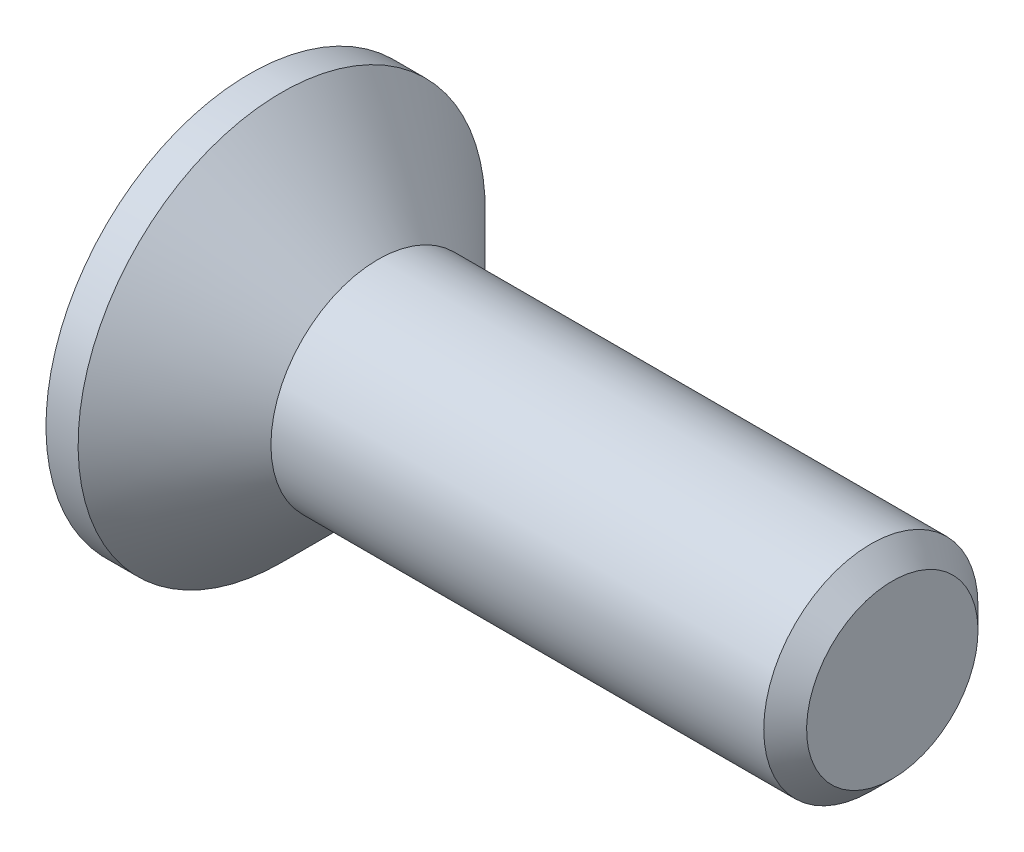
ISO-10303-21;
HEADER;
FILE_DESCRIPTION(('STEP AP214'),'2;1');
FILE_NAME('part.step','',(''),(''),'','','');
FILE_SCHEMA(('AUTOMOTIVE_DESIGN { 1 0 10303 214 1 1 1 1 }'));
ENDSEC;
DATA;
#1=APPLICATION_CONTEXT('core data for automotive mechanical design processes');
#2=APPLICATION_PROTOCOL_DEFINITION('international standard','automotive_design',2000,#1);
#3=PRODUCT_CONTEXT('',#1,'mechanical');
#4=PRODUCT('Part','Part','',(#3));
#5=PRODUCT_RELATED_PRODUCT_CATEGORY('part','',(#4));
#6=PRODUCT_DEFINITION_FORMATION('','',#4);
#7=PRODUCT_DEFINITION_CONTEXT('part definition',#1,'design');
#8=PRODUCT_DEFINITION('design','',#6,#7);
#9=PRODUCT_DEFINITION_SHAPE('','',#8);
#10=(LENGTH_UNIT() NAMED_UNIT(*) SI_UNIT(.MILLI.,.METRE.));
#11=(NAMED_UNIT(*) PLANE_ANGLE_UNIT() SI_UNIT($,.RADIAN.));
#12=(NAMED_UNIT(*) SI_UNIT($,.STERADIAN.) SOLID_ANGLE_UNIT());
#13=UNCERTAINTY_MEASURE_WITH_UNIT(LENGTH_MEASURE(1.E-05),#10,'distance_accuracy_value','');
#14=(GEOMETRIC_REPRESENTATION_CONTEXT(3) GLOBAL_UNCERTAINTY_ASSIGNED_CONTEXT((#13)) GLOBAL_UNIT_ASSIGNED_CONTEXT((#10,
#11,#12)) REPRESENTATION_CONTEXT('',''));
#15=CARTESIAN_POINT('',(0.,0.,0.));
#16=DIRECTION('',(0.,0.,1.));
#17=DIRECTION('',(1.,0.,0.));
#18=AXIS2_PLACEMENT_3D('',#15,#16,#17);
#19=CARTESIAN_POINT('',(0.,0.,0.));
#20=DIRECTION('',(-1.,0.,0.));
#21=DIRECTION('',(0.,-1.,0.));
#22=AXIS2_PLACEMENT_3D('',#19,#20,#21);
#23=CONICAL_SURFACE('',#22,1.,0.78539816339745);
#24=CARTESIAN_POINT('',(-0.899999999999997,0.,0.));
#25=DIRECTION('',(-1.,0.,0.));
#26=DIRECTION('',(0.,-1.,0.));
#27=AXIS2_PLACEMENT_3D('',#24,#25,#26);
#28=CIRCLE('',#27,1.9);
#29=CARTESIAN_POINT('',(-0.899999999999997,-1.9,0.));
#30=VERTEX_POINT('',#29);
#31=EDGE_CURVE('E189',#30,#30,#28,.T.);
#32=ORIENTED_EDGE('',*,*,#31,.F.);
#33=EDGE_LOOP('',(#32));
#34=FACE_BOUND('',#33,.T.);
#35=CARTESIAN_POINT('',(0.,0.,0.));
#36=DIRECTION('',(-1.,0.,0.));
#37=DIRECTION('',(0.,-1.,0.));
#38=AXIS2_PLACEMENT_3D('',#35,#36,#37);
#39=CIRCLE('',#38,1.);
#40=CARTESIAN_POINT('',(0.,-1.,0.));
#41=VERTEX_POINT('',#40);
#42=EDGE_CURVE('E212',#41,#41,#39,.T.);
#43=ORIENTED_EDGE('',*,*,#42,.T.);
#44=EDGE_LOOP('',(#43));
#45=FACE_BOUND('',#44,.T.);
#46=ADVANCED_FACE('F33',(#34,#45),#23,.T.);
#47=CARTESIAN_POINT('',(-1.2,0.,0.));
#48=DIRECTION('',(-1.,0.,0.));
#49=DIRECTION('',(0.,-1.,0.));
#50=AXIS2_PLACEMENT_3D('',#47,#48,#49);
#51=CYLINDRICAL_SURFACE('',#50,1.);
#52=CARTESIAN_POINT('',(4.6,0.,0.));
#53=DIRECTION('',(-1.,0.,0.));
#54=DIRECTION('',(0.,-1.,0.));
#55=AXIS2_PLACEMENT_3D('',#52,#53,#54);
#56=CIRCLE('',#55,1.);
#57=CARTESIAN_POINT('',(4.6,-1.,0.));
#58=VERTEX_POINT('',#57);
#59=EDGE_CURVE('E41',#58,#58,#56,.T.);
#60=ORIENTED_EDGE('',*,*,#59,.T.);
#61=EDGE_LOOP('',(#60));
#62=FACE_BOUND('',#61,.T.);
#63=ORIENTED_EDGE('',*,*,#42,.F.);
#64=EDGE_LOOP('',(#63));
#65=FACE_BOUND('',#64,.T.);
#66=ADVANCED_FACE('F217',(#62,#65),#51,.T.);
#67=CARTESIAN_POINT('',(4.8,0.,0.));
#68=DIRECTION('',(-1.,0.,0.));
#69=DIRECTION('',(0.,-1.,0.));
#70=AXIS2_PLACEMENT_3D('',#67,#68,#69);
#71=PLANE('',#70);
#72=CARTESIAN_POINT('',(4.8,0.,0.));
#73=DIRECTION('',(-1.,0.,0.));
#74=DIRECTION('',(0.,-1.,0.));
#75=AXIS2_PLACEMENT_3D('',#72,#73,#74);
#76=CIRCLE('',#75,0.799999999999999);
#77=CARTESIAN_POINT('',(4.8,-0.799999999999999,0.));
#78=VERTEX_POINT('',#77);
#79=EDGE_CURVE('E11',#78,#78,#76,.F.);
#80=ORIENTED_EDGE('',*,*,#79,.T.);
#81=EDGE_LOOP('',(#80));
#82=FACE_BOUND('',#81,.T.);
#83=ADVANCED_FACE('F239',(#82),#71,.F.);
#84=CARTESIAN_POINT('',(-1.2,1.9,0.));
#85=DIRECTION('',(1.,0.,0.));
#86=DIRECTION('',(0.,1.,0.));
#87=AXIS2_PLACEMENT_3D('',#84,#85,#86);
#88=PLANE('',#87);
#89=DIRECTION('',(0.,0.,-1.));
#90=VECTOR('',#89,1.);
#91=CARTESIAN_POINT('',(-1.2,0.3,-1.175));
#92=LINE('',#91,#90);
#93=CARTESIAN_POINT('',(-1.2,0.3,-0.3));
#94=VERTEX_POINT('',#93);
#95=CARTESIAN_POINT('',(-1.2,0.3,-1.175));
#96=VERTEX_POINT('',#95);
#97=EDGE_CURVE('E158',#94,#96,#92,.T.);
#98=ORIENTED_EDGE('',*,*,#97,.F.);
#99=DIRECTION('',(0.,-1.,0.));
#100=VECTOR('',#99,1.);
#101=CARTESIAN_POINT('',(-1.2,0.3,-0.3));
#102=LINE('',#101,#100);
#103=CARTESIAN_POINT('',(-1.2,1.175,-0.3));
#104=VERTEX_POINT('',#103);
#105=EDGE_CURVE('E48',#104,#94,#102,.T.);
#106=ORIENTED_EDGE('',*,*,#105,.F.);
#107=DIRECTION('',(0.,0.,-1.));
#108=VECTOR('',#107,1.);
#109=CARTESIAN_POINT('',(-1.2,1.175,-0.3));
#110=LINE('',#109,#108);
#111=CARTESIAN_POINT('',(-1.2,1.175,0.3));
#112=VERTEX_POINT('',#111);
#113=EDGE_CURVE('E185',#112,#104,#110,.T.);
#114=ORIENTED_EDGE('',*,*,#113,.F.);
#115=DIRECTION('',(0.,1.,0.));
#116=VECTOR('',#115,1.);
#117=CARTESIAN_POINT('',(-1.2,1.175,0.3));
#118=LINE('',#117,#116);
#119=CARTESIAN_POINT('',(-1.2,0.3,0.3));
#120=VERTEX_POINT('',#119);
#121=EDGE_CURVE('E183',#120,#112,#118,.T.);
#122=ORIENTED_EDGE('',*,*,#121,.F.);
#123=DIRECTION('',(0.,0.,-1.));
#124=VECTOR('',#123,1.);
#125=CARTESIAN_POINT('',(-1.2,0.3,0.3));
#126=LINE('',#125,#124);
#127=CARTESIAN_POINT('',(-1.2,0.3,1.175));
#128=VERTEX_POINT('',#127);
#129=EDGE_CURVE('E132',#128,#120,#126,.T.);
#130=ORIENTED_EDGE('',*,*,#129,.F.);
#131=DIRECTION('',(0.,1.,0.));
#132=VECTOR('',#131,1.);
#133=CARTESIAN_POINT('',(-1.2,0.3,1.175));
#134=LINE('',#133,#132);
#135=CARTESIAN_POINT('',(-1.2,-0.3,1.175));
#136=VERTEX_POINT('',#135);
#137=EDGE_CURVE('E179',#136,#128,#134,.T.);
#138=ORIENTED_EDGE('',*,*,#137,.F.);
#139=DIRECTION('',(0.,0.,1.));
#140=VECTOR('',#139,1.);
#141=CARTESIAN_POINT('',(-1.2,-0.3,1.175));
#142=LINE('',#141,#140);
#143=CARTESIAN_POINT('',(-1.2,-0.3,0.3));
#144=VERTEX_POINT('',#143);
#145=EDGE_CURVE('E176',#144,#136,#142,.T.);
#146=ORIENTED_EDGE('',*,*,#145,.F.);
#147=DIRECTION('',(0.,1.,0.));
#148=VECTOR('',#147,1.);
#149=CARTESIAN_POINT('',(-1.2,-0.3,0.3));
#150=LINE('',#149,#148);
#151=CARTESIAN_POINT('',(-1.2,-1.175,0.3));
#152=VERTEX_POINT('',#151);
#153=EDGE_CURVE('E173',#152,#144,#150,.T.);
#154=ORIENTED_EDGE('',*,*,#153,.F.);
#155=DIRECTION('',(0.,0.,1.));
#156=VECTOR('',#155,1.);
#157=CARTESIAN_POINT('',(-1.2,-1.175,0.3));
#158=LINE('',#157,#156);
#159=CARTESIAN_POINT('',(-1.2,-1.175,-0.3));
#160=VERTEX_POINT('',#159);
#161=EDGE_CURVE('E170',#160,#152,#158,.T.);
#162=ORIENTED_EDGE('',*,*,#161,.F.);
#163=DIRECTION('',(0.,-1.,0.));
#164=VECTOR('',#163,1.);
#165=CARTESIAN_POINT('',(-1.2,-1.175,-0.3));
#166=LINE('',#165,#164);
#167=CARTESIAN_POINT('',(-1.2,-0.3,-0.3));
#168=VERTEX_POINT('',#167);
#169=EDGE_CURVE('E167',#168,#160,#166,.T.);
#170=ORIENTED_EDGE('',*,*,#169,.F.);
#171=DIRECTION('',(0.,0.,1.));
#172=VECTOR('',#171,1.);
#173=CARTESIAN_POINT('',(-1.2,-0.3,-0.3));
#174=LINE('',#173,#172);
#175=CARTESIAN_POINT('',(-1.2,-0.3,-1.175));
#176=VERTEX_POINT('',#175);
#177=EDGE_CURVE('E164',#176,#168,#174,.T.);
#178=ORIENTED_EDGE('',*,*,#177,.F.);
#179=DIRECTION('',(0.,-1.,0.));
#180=VECTOR('',#179,1.);
#181=CARTESIAN_POINT('',(-1.2,-0.3,-1.175));
#182=LINE('',#181,#180);
#183=EDGE_CURVE('E161',#96,#176,#182,.T.);
#184=ORIENTED_EDGE('',*,*,#183,.F.);
#185=EDGE_LOOP('',(#98,#106,#114,#122,#130,#138,#146,#154,#162,#170,#178,#184));
#186=FACE_BOUND('',#185,.T.);
#187=CARTESIAN_POINT('',(-1.2,0.,0.));
#188=DIRECTION('',(-1.,0.,0.));
#189=DIRECTION('',(0.,-1.,0.));
#190=AXIS2_PLACEMENT_3D('',#187,#188,#189);
#191=CIRCLE('',#190,1.9);
#192=CARTESIAN_POINT('',(-1.2,-1.9,0.));
#193=VERTEX_POINT('',#192);
#194=EDGE_CURVE('E209',#193,#193,#191,.T.);
#195=ORIENTED_EDGE('',*,*,#194,.T.);
#196=EDGE_LOOP('',(#195));
#197=FACE_BOUND('',#196,.T.);
#198=ADVANCED_FACE('F230',(#186,#197),#88,.F.);
#199=CARTESIAN_POINT('',(-1.2,0.,0.));
#200=DIRECTION('',(-1.,0.,0.));
#201=DIRECTION('',(0.,-1.,0.));
#202=AXIS2_PLACEMENT_3D('',#199,#200,#201);
#203=CYLINDRICAL_SURFACE('',#202,1.9);
#204=ORIENTED_EDGE('',*,*,#194,.F.);
#205=EDGE_LOOP('',(#204));
#206=FACE_BOUND('',#205,.T.);
#207=ORIENTED_EDGE('',*,*,#31,.T.);
#208=EDGE_LOOP('',(#207));
#209=FACE_BOUND('',#208,.T.);
#210=ADVANCED_FACE('F222',(#206,#209),#203,.T.);
#211=CARTESIAN_POINT('',(4.6,0.,0.));
#212=DIRECTION('',(-1.,0.,0.));
#213=DIRECTION('',(0.,-1.,0.));
#214=AXIS2_PLACEMENT_3D('',#211,#212,#213);
#215=CONICAL_SURFACE('',#214,1.,0.78539816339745);
#216=ORIENTED_EDGE('',*,*,#79,.F.);
#217=EDGE_LOOP('',(#216));
#218=FACE_BOUND('',#217,.T.);
#219=ORIENTED_EDGE('',*,*,#59,.F.);
#220=EDGE_LOOP('',(#219));
#221=FACE_BOUND('',#220,.T.);
#222=ADVANCED_FACE('F35',(#218,#221),#215,.T.);
#223=CARTESIAN_POINT('',(-0.249999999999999,0.3,-0.3));
#224=DIRECTION('',(0.,0.,-1.));
#225=DIRECTION('',(0.,1.,0.));
#226=AXIS2_PLACEMENT_3D('',#223,#224,#225);
#227=PLANE('',#226);
#228=ORIENTED_EDGE('',*,*,#105,.T.);
#229=DIRECTION('',(-1.,0.,0.));
#230=VECTOR('',#229,1.);
#231=CARTESIAN_POINT('',(-0.249999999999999,0.3,-0.3));
#232=LINE('',#231,#230);
#233=CARTESIAN_POINT('',(-0.249999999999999,0.3,-0.3));
#234=VERTEX_POINT('',#233);
#235=EDGE_CURVE('E96',#234,#94,#232,.T.);
#236=ORIENTED_EDGE('',*,*,#235,.F.);
#237=DIRECTION('',(0.,-1.,0.));
#238=VECTOR('',#237,1.);
#239=CARTESIAN_POINT('',(-0.249999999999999,0.3,-0.3));
#240=LINE('',#239,#238);
#241=CARTESIAN_POINT('',(-0.249999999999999,1.175,-0.3));
#242=VERTEX_POINT('',#241);
#243=EDGE_CURVE('E187',#242,#234,#240,.T.);
#244=ORIENTED_EDGE('',*,*,#243,.F.);
#245=DIRECTION('',(-1.,0.,0.));
#246=VECTOR('',#245,1.);
#247=CARTESIAN_POINT('',(-0.249999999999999,1.175,-0.3));
#248=LINE('',#247,#246);
#249=EDGE_CURVE('E56',#242,#104,#248,.T.);
#250=ORIENTED_EDGE('',*,*,#249,.T.);
#251=EDGE_LOOP('',(#228,#236,#244,#250));
#252=FACE_BOUND('',#251,.T.);
#253=ADVANCED_FACE('F221',(#252),#227,.F.);
#254=CARTESIAN_POINT('',(-0.249999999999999,1.175,-0.3));
#255=DIRECTION('',(0.,1.,0.));
#256=DIRECTION('',(-1.,0.,0.));
#257=AXIS2_PLACEMENT_3D('',#254,#255,#256);
#258=PLANE('',#257);
#259=ORIENTED_EDGE('',*,*,#113,.T.);
#260=ORIENTED_EDGE('',*,*,#249,.F.);
#261=DIRECTION('',(0.,0.,-1.));
#262=VECTOR('',#261,1.);
#263=CARTESIAN_POINT('',(-0.249999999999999,1.175,-0.3));
#264=LINE('',#263,#262);
#265=CARTESIAN_POINT('',(-0.249999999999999,1.175,0.3));
#266=VERTEX_POINT('',#265);
#267=EDGE_CURVE('E144',#266,#242,#264,.T.);
#268=ORIENTED_EDGE('',*,*,#267,.F.);
#269=DIRECTION('',(-1.,0.,0.));
#270=VECTOR('',#269,1.);
#271=CARTESIAN_POINT('',(-0.249999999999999,1.175,0.3));
#272=LINE('',#271,#270);
#273=EDGE_CURVE('E136',#266,#112,#272,.T.);
#274=ORIENTED_EDGE('',*,*,#273,.T.);
#275=EDGE_LOOP('',(#259,#260,#268,#274));
#276=FACE_BOUND('',#275,.T.);
#277=ADVANCED_FACE('F228',(#276),#258,.F.);
#278=CARTESIAN_POINT('',(-0.249999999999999,1.175,0.3));
#279=DIRECTION('',(0.,0.,1.));
#280=DIRECTION('',(0.,-1.,0.));
#281=AXIS2_PLACEMENT_3D('',#278,#279,#280);
#282=PLANE('',#281);
#283=ORIENTED_EDGE('',*,*,#121,.T.);
#284=ORIENTED_EDGE('',*,*,#273,.F.);
#285=DIRECTION('',(0.,1.,0.));
#286=VECTOR('',#285,1.);
#287=CARTESIAN_POINT('',(-0.249999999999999,1.175,0.3));
#288=LINE('',#287,#286);
#289=CARTESIAN_POINT('',(-0.249999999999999,0.3,0.3));
#290=VERTEX_POINT('',#289);
#291=EDGE_CURVE('E140',#290,#266,#288,.T.);
#292=ORIENTED_EDGE('',*,*,#291,.F.);
#293=DIRECTION('',(-1.,0.,0.));
#294=VECTOR('',#293,1.);
#295=CARTESIAN_POINT('',(-0.249999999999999,0.3,0.3));
#296=LINE('',#295,#294);
#297=EDGE_CURVE('E125',#290,#120,#296,.T.);
#298=ORIENTED_EDGE('',*,*,#297,.T.);
#299=EDGE_LOOP('',(#283,#284,#292,#298));
#300=FACE_BOUND('',#299,.T.);
#301=ADVANCED_FACE('F141',(#300),#282,.F.);
#302=CARTESIAN_POINT('',(-0.249999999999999,0.3,0.3));
#303=DIRECTION('',(0.,1.,0.));
#304=DIRECTION('',(0.,0.,1.));
#305=AXIS2_PLACEMENT_3D('',#302,#303,#304);
#306=PLANE('',#305);
#307=ORIENTED_EDGE('',*,*,#129,.T.);
#308=ORIENTED_EDGE('',*,*,#297,.F.);
#309=DIRECTION('',(0.,0.,-1.));
#310=VECTOR('',#309,1.);
#311=CARTESIAN_POINT('',(-0.249999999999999,0.3,0.3));
#312=LINE('',#311,#310);
#313=CARTESIAN_POINT('',(-0.249999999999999,0.3,1.175));
#314=VERTEX_POINT('',#313);
#315=EDGE_CURVE('E129',#314,#290,#312,.T.);
#316=ORIENTED_EDGE('',*,*,#315,.F.);
#317=DIRECTION('',(-1.,0.,0.));
#318=VECTOR('',#317,1.);
#319=CARTESIAN_POINT('',(-0.249999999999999,0.3,1.175));
#320=LINE('',#319,#318);
#321=EDGE_CURVE('E137',#314,#128,#320,.T.);
#322=ORIENTED_EDGE('',*,*,#321,.T.);
#323=EDGE_LOOP('',(#307,#308,#316,#322));
#324=FACE_BOUND('',#323,.T.);
#325=ADVANCED_FACE('F127',(#324),#306,.F.);
#326=CARTESIAN_POINT('',(-0.249999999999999,0.3,1.175));
#327=DIRECTION('',(0.,0.,1.));
#328=DIRECTION('',(1.,0.,0.));
#329=AXIS2_PLACEMENT_3D('',#326,#327,#328);
#330=PLANE('',#329);
#331=ORIENTED_EDGE('',*,*,#137,.T.);
#332=ORIENTED_EDGE('',*,*,#321,.F.);
#333=DIRECTION('',(0.,1.,0.));
#334=VECTOR('',#333,1.);
#335=CARTESIAN_POINT('',(-0.249999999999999,0.3,1.175));
#336=LINE('',#335,#334);
#337=CARTESIAN_POINT('',(-0.249999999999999,-0.3,1.175));
#338=VERTEX_POINT('',#337);
#339=EDGE_CURVE('E150',#338,#314,#336,.T.);
#340=ORIENTED_EDGE('',*,*,#339,.F.);
#341=DIRECTION('',(-1.,0.,0.));
#342=VECTOR('',#341,1.);
#343=CARTESIAN_POINT('',(-0.249999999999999,-0.3,1.175));
#344=LINE('',#343,#342);
#345=EDGE_CURVE('E192',#338,#136,#344,.T.);
#346=ORIENTED_EDGE('',*,*,#345,.T.);
#347=EDGE_LOOP('',(#331,#332,#340,#346));
#348=FACE_BOUND('',#347,.T.);
#349=ADVANCED_FACE('F277',(#348),#330,.F.);
#350=CARTESIAN_POINT('',(-0.249999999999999,-0.3,1.175));
#351=DIRECTION('',(0.,-1.,0.));
#352=DIRECTION('',(0.,0.,-1.));
#353=AXIS2_PLACEMENT_3D('',#350,#351,#352);
#354=PLANE('',#353);
#355=ORIENTED_EDGE('',*,*,#145,.T.);
#356=ORIENTED_EDGE('',*,*,#345,.F.);
#357=DIRECTION('',(0.,0.,1.));
#358=VECTOR('',#357,1.);
#359=CARTESIAN_POINT('',(-0.249999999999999,-0.3,1.175));
#360=LINE('',#359,#358);
#361=CARTESIAN_POINT('',(-0.249999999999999,-0.3,0.3));
#362=VERTEX_POINT('',#361);
#363=EDGE_CURVE('E152',#362,#338,#360,.T.);
#364=ORIENTED_EDGE('',*,*,#363,.F.);
#365=DIRECTION('',(-1.,0.,0.));
#366=VECTOR('',#365,1.);
#367=CARTESIAN_POINT('',(-0.249999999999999,-0.3,0.3));
#368=LINE('',#367,#366);
#369=EDGE_CURVE('E194',#362,#144,#368,.T.);
#370=ORIENTED_EDGE('',*,*,#369,.T.);
#371=EDGE_LOOP('',(#355,#356,#364,#370));
#372=FACE_BOUND('',#371,.T.);
#373=ADVANCED_FACE('F273',(#372),#354,.F.);
#374=CARTESIAN_POINT('',(-0.249999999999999,-0.3,0.3));
#375=DIRECTION('',(0.,0.,1.));
#376=DIRECTION('',(1.,0.,0.));
#377=AXIS2_PLACEMENT_3D('',#374,#375,#376);
#378=PLANE('',#377);
#379=ORIENTED_EDGE('',*,*,#153,.T.);
#380=ORIENTED_EDGE('',*,*,#369,.F.);
#381=DIRECTION('',(0.,1.,0.));
#382=VECTOR('',#381,1.);
#383=CARTESIAN_POINT('',(-0.249999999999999,-0.3,0.3));
#384=LINE('',#383,#382);
#385=CARTESIAN_POINT('',(-0.249999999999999,-1.175,0.3));
#386=VERTEX_POINT('',#385);
#387=EDGE_CURVE('E422',#386,#362,#384,.T.);
#388=ORIENTED_EDGE('',*,*,#387,.F.);
#389=DIRECTION('',(-1.,0.,0.));
#390=VECTOR('',#389,1.);
#391=CARTESIAN_POINT('',(-0.249999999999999,-1.175,0.3));
#392=LINE('',#391,#390);
#393=EDGE_CURVE('E196',#386,#152,#392,.T.);
#394=ORIENTED_EDGE('',*,*,#393,.T.);
#395=EDGE_LOOP('',(#379,#380,#388,#394));
#396=FACE_BOUND('',#395,.T.);
#397=ADVANCED_FACE('F269',(#396),#378,.F.);
#398=CARTESIAN_POINT('',(-0.249999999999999,-1.175,0.3));
#399=DIRECTION('',(0.,-1.,0.));
#400=DIRECTION('',(1.,0.,0.));
#401=AXIS2_PLACEMENT_3D('',#398,#399,#400);
#402=PLANE('',#401);
#403=ORIENTED_EDGE('',*,*,#161,.T.);
#404=ORIENTED_EDGE('',*,*,#393,.F.);
#405=DIRECTION('',(0.,0.,1.));
#406=VECTOR('',#405,1.);
#407=CARTESIAN_POINT('',(-0.249999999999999,-1.175,0.3));
#408=LINE('',#407,#406);
#409=CARTESIAN_POINT('',(-0.249999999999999,-1.175,-0.3));
#410=VERTEX_POINT('',#409);
#411=EDGE_CURVE('E419',#410,#386,#408,.T.);
#412=ORIENTED_EDGE('',*,*,#411,.F.);
#413=DIRECTION('',(-1.,0.,0.));
#414=VECTOR('',#413,1.);
#415=CARTESIAN_POINT('',(-0.249999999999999,-1.175,-0.3));
#416=LINE('',#415,#414);
#417=EDGE_CURVE('E198',#410,#160,#416,.T.);
#418=ORIENTED_EDGE('',*,*,#417,.T.);
#419=EDGE_LOOP('',(#403,#404,#412,#418));
#420=FACE_BOUND('',#419,.T.);
#421=ADVANCED_FACE('F265',(#420),#402,.F.);
#422=CARTESIAN_POINT('',(-0.249999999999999,-1.175,-0.3));
#423=DIRECTION('',(0.,0.,-1.));
#424=DIRECTION('',(0.,1.,0.));
#425=AXIS2_PLACEMENT_3D('',#422,#423,#424);
#426=PLANE('',#425);
#427=ORIENTED_EDGE('',*,*,#169,.T.);
#428=ORIENTED_EDGE('',*,*,#417,.F.);
#429=DIRECTION('',(0.,-1.,0.));
#430=VECTOR('',#429,1.);
#431=CARTESIAN_POINT('',(-0.249999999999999,-1.175,-0.3));
#432=LINE('',#431,#430);
#433=CARTESIAN_POINT('',(-0.249999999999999,-0.3,-0.3));
#434=VERTEX_POINT('',#433);
#435=EDGE_CURVE('E416',#434,#410,#432,.T.);
#436=ORIENTED_EDGE('',*,*,#435,.F.);
#437=DIRECTION('',(-1.,0.,0.));
#438=VECTOR('',#437,1.);
#439=CARTESIAN_POINT('',(-0.249999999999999,-0.3,-0.3));
#440=LINE('',#439,#438);
#441=EDGE_CURVE('E200',#434,#168,#440,.T.);
#442=ORIENTED_EDGE('',*,*,#441,.T.);
#443=EDGE_LOOP('',(#427,#428,#436,#442));
#444=FACE_BOUND('',#443,.T.);
#445=ADVANCED_FACE('F261',(#444),#426,.F.);
#446=CARTESIAN_POINT('',(-0.249999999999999,-0.3,-0.3));
#447=DIRECTION('',(0.,-1.,0.));
#448=DIRECTION('',(0.,0.,-1.));
#449=AXIS2_PLACEMENT_3D('',#446,#447,#448);
#450=PLANE('',#449);
#451=ORIENTED_EDGE('',*,*,#177,.T.);
#452=ORIENTED_EDGE('',*,*,#441,.F.);
#453=DIRECTION('',(0.,0.,1.));
#454=VECTOR('',#453,1.);
#455=CARTESIAN_POINT('',(-0.249999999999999,-0.3,-0.3));
#456=LINE('',#455,#454);
#457=CARTESIAN_POINT('',(-0.249999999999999,-0.3,-1.175));
#458=VERTEX_POINT('',#457);
#459=EDGE_CURVE('E413',#458,#434,#456,.T.);
#460=ORIENTED_EDGE('',*,*,#459,.F.);
#461=DIRECTION('',(-1.,0.,0.));
#462=VECTOR('',#461,1.);
#463=CARTESIAN_POINT('',(-0.249999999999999,-0.3,-1.175));
#464=LINE('',#463,#462);
#465=EDGE_CURVE('E202',#458,#176,#464,.T.);
#466=ORIENTED_EDGE('',*,*,#465,.T.);
#467=EDGE_LOOP('',(#451,#452,#460,#466));
#468=FACE_BOUND('',#467,.T.);
#469=ADVANCED_FACE('F257',(#468),#450,.F.);
#470=CARTESIAN_POINT('',(-0.249999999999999,-0.3,-1.175));
#471=DIRECTION('',(0.,0.,-1.));
#472=DIRECTION('',(-1.,0.,0.));
#473=AXIS2_PLACEMENT_3D('',#470,#471,#472);
#474=PLANE('',#473);
#475=ORIENTED_EDGE('',*,*,#183,.T.);
#476=ORIENTED_EDGE('',*,*,#465,.F.);
#477=DIRECTION('',(0.,-1.,0.));
#478=VECTOR('',#477,1.);
#479=CARTESIAN_POINT('',(-0.249999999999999,-0.3,-1.175));
#480=LINE('',#479,#478);
#481=CARTESIAN_POINT('',(-0.249999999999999,0.3,-1.175));
#482=VERTEX_POINT('',#481);
#483=EDGE_CURVE('E408',#482,#458,#480,.T.);
#484=ORIENTED_EDGE('',*,*,#483,.F.);
#485=DIRECTION('',(-1.,0.,0.));
#486=VECTOR('',#485,1.);
#487=CARTESIAN_POINT('',(-0.249999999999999,0.3,-1.175));
#488=LINE('',#487,#486);
#489=EDGE_CURVE('E204',#482,#96,#488,.T.);
#490=ORIENTED_EDGE('',*,*,#489,.T.);
#491=EDGE_LOOP('',(#475,#476,#484,#490));
#492=FACE_BOUND('',#491,.T.);
#493=ADVANCED_FACE('F253',(#492),#474,.F.);
#494=CARTESIAN_POINT('',(-0.249999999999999,0.3,-1.175));
#495=DIRECTION('',(0.,1.,0.));
#496=DIRECTION('',(0.,0.,1.));
#497=AXIS2_PLACEMENT_3D('',#494,#495,#496);
#498=PLANE('',#497);
#499=ORIENTED_EDGE('',*,*,#97,.T.);
#500=ORIENTED_EDGE('',*,*,#489,.F.);
#501=DIRECTION('',(0.,0.,-1.));
#502=VECTOR('',#501,1.);
#503=CARTESIAN_POINT('',(-0.249999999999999,0.3,-1.175));
#504=LINE('',#503,#502);
#505=EDGE_CURVE('E406',#234,#482,#504,.T.);
#506=ORIENTED_EDGE('',*,*,#505,.F.);
#507=ORIENTED_EDGE('',*,*,#235,.T.);
#508=EDGE_LOOP('',(#499,#500,#506,#507));
#509=FACE_BOUND('',#508,.T.);
#510=ADVANCED_FACE('F250',(#509),#498,.F.);
#511=CARTESIAN_POINT('',(-0.249999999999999,0.,0.));
#512=DIRECTION('',(1.,0.,0.));
#513=DIRECTION('',(0.,0.,-1.));
#514=AXIS2_PLACEMENT_3D('',#511,#512,#513);
#515=PLANE('',#514);
#516=ORIENTED_EDGE('',*,*,#243,.T.);
#517=ORIENTED_EDGE('',*,*,#505,.T.);
#518=ORIENTED_EDGE('',*,*,#483,.T.);
#519=ORIENTED_EDGE('',*,*,#459,.T.);
#520=ORIENTED_EDGE('',*,*,#435,.T.);
#521=ORIENTED_EDGE('',*,*,#411,.T.);
#522=ORIENTED_EDGE('',*,*,#387,.T.);
#523=ORIENTED_EDGE('',*,*,#363,.T.);
#524=ORIENTED_EDGE('',*,*,#339,.T.);
#525=ORIENTED_EDGE('',*,*,#315,.T.);
#526=ORIENTED_EDGE('',*,*,#291,.T.);
#527=ORIENTED_EDGE('',*,*,#267,.T.);
#528=EDGE_LOOP('',(#516,#517,#518,#519,#520,#521,#522,#523,#524,#525,#526,#527));
#529=FACE_BOUND('',#528,.T.);
#530=ADVANCED_FACE('F147',(#529),#515,.F.);
#531=CLOSED_SHELL('',(#46,#66,#83,#198,#210,#222,#253,#277,#301,#325,#349,#373,#397,#421,#445,
#469,#493,#510,#530));
#532=MANIFOLD_SOLID_BREP('B2',#531);
#533=ADVANCED_BREP_SHAPE_REPRESENTATION('',(#18,#532),#14);
#534=SHAPE_DEFINITION_REPRESENTATION(#9,#533);
ENDSEC;
END-ISO-10303-21;
